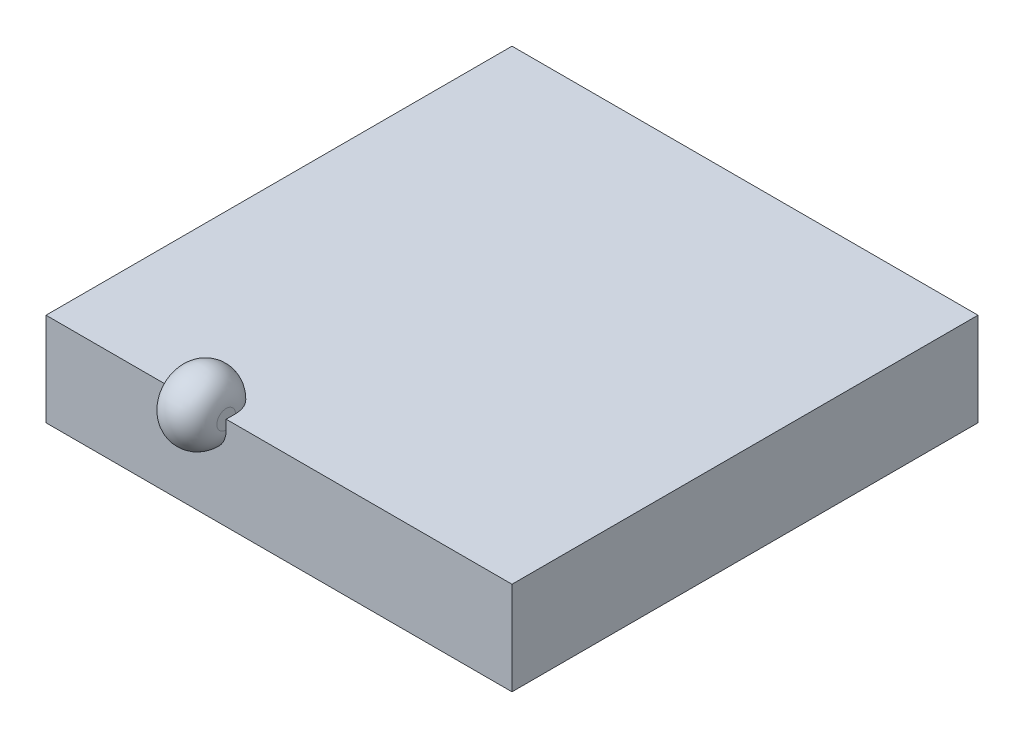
from build123d import *

# Parameters (mm, degrees)
SKETCH1_W           = 150
SKETCH1_H           = 150
BOSS_EXTRUDE1_DEPTH = 30


with BuildPart() as part:
    # Sketch1 → Boss-Extrude1 (new body)
    with BuildSketch(Plane(origin=(0, 0, 0), x_dir=(1, 0, 0), z_dir=(0, 1, 0))):
        Rectangle(SKETCH1_W, SKETCH1_H)
    extrude(amount=BOSS_EXTRUDE1_DEPTH)


with BuildPart() as body_2:
    # Sketch3 → Revolve1 (revolve)
    with BuildSketch(Plane.XY.offset(75)):
        with BuildLine():
            Line((-33, 30), (-33, 27))
            ThreePointArc((-33, 27), (-25, 19), (-17, 27))
            Line((-17, 27), (-17, 30))
            Line((-17, 30), (-33, 30))
        make_face()
    revolve(axis=Axis((-33, 30, 75), (1, 0, 0)))


solid = Compound([part.part, body_2.part])
